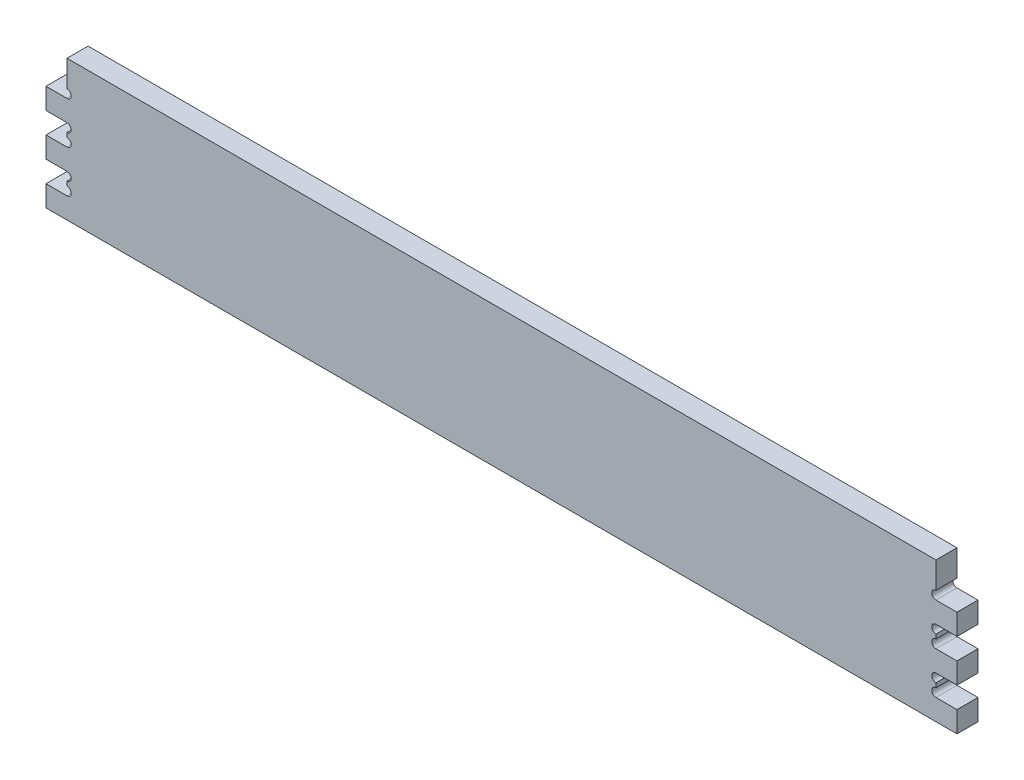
from build123d import *

# Parameters (mm, degrees)
AUFSATZ_LINEAR_AUSTRAGEN1_DEPTH = 15


with BuildPart() as part:
    # Skizze1 → Aufsatz-Linear austragen1 (new body)
    with BuildSketch(Plane.XY):
        with BuildLine():
            Line((0, 0), (620, 0))
            Line((620, 0), (635, 0))
            Line((635, 0), (635, 15))
            Line((635, 15), (620, 15))
            ThreePointArc((620, 15), (617, 18), (620, 21))
            Line((620, 21), (620, 24.1))
            ThreePointArc((620, 24.1), (617, 27.1), (620, 30.1))
            Line((620, 30.1), (635, 30.1))
            Line((635, 30.1), (635, 45.1))
            Line((635, 45.1), (620, 45.1))
            ThreePointArc((620, 45.1), (617, 48.1), (620, 51.1))
            Line((620, 51.1), (620, 54.2))
            ThreePointArc((620, 54.2), (617, 57.2), (620, 60.2))
            Line((620, 60.2), (635, 60.2))
            Line((635, 60.2), (635, 75.2))
            Line((635, 75.2), (620, 75.2))
            ThreePointArc((620, 75.2), (617, 78.2), (620, 81.2))
            Line((620, 81.2), (620, 100))
            Line((620, 100), (0, 100))
            Line((0, 100), (0, 81.2))
            ThreePointArc((0, 81.2), (3, 78.2), (0, 75.2))
            Line((0, 75.2), (-15, 75.2))
            Line((-15, 75.2), (-15, 60.2))
            Line((-15, 60.2), (0, 60.2))
            ThreePointArc((0, 60.2), (3, 57.2), (0, 54.2))
            Line((0, 54.2), (0, 51.1))
            ThreePointArc((0, 51.1), (3, 48.1), (0, 45.1))
            Line((0, 45.1), (-15, 45.1))
            Line((-15, 45.1), (-15, 30.1))
            Line((-15, 30.1), (0, 30.1))
            ThreePointArc((0, 30.1), (3, 27.1), (0, 24.1))
            Line((0, 24.1), (0, 21))
            ThreePointArc((0, 21), (3, 18), (0, 15))
            Line((0, 15), (-15, 15))
            Line((-15, 15), (-15, 0))
            Line((-15, 0), (0, 0))
        make_face()
    extrude(amount=AUFSATZ_LINEAR_AUSTRAGEN1_DEPTH)


solid = part.part
